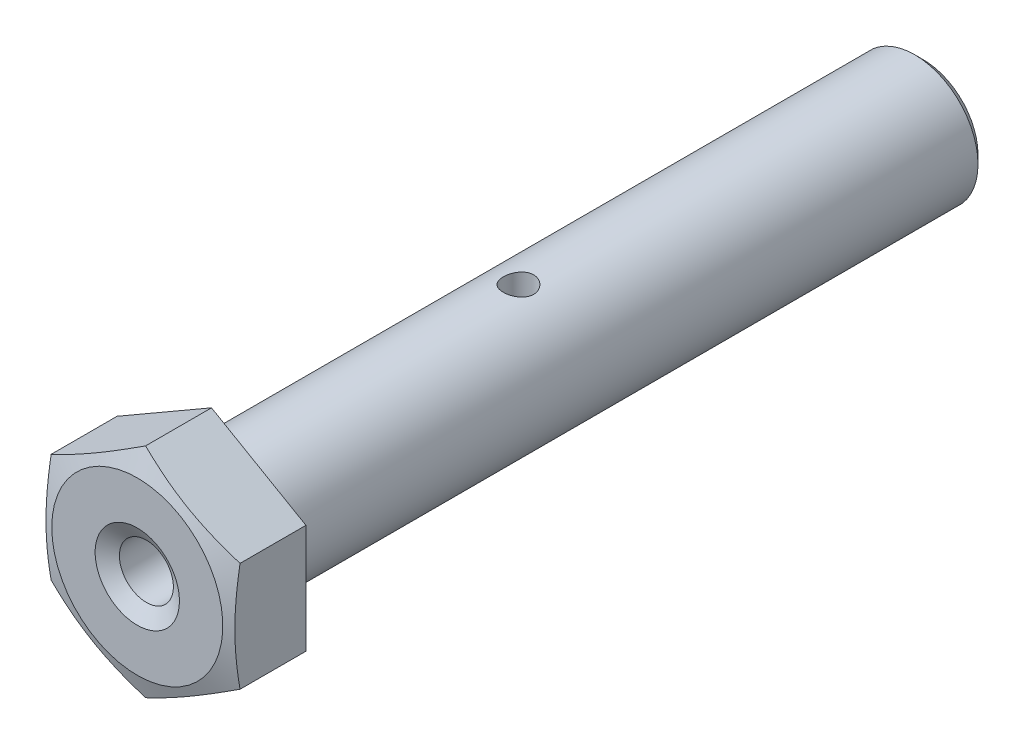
ISO-10303-21;
HEADER;
FILE_DESCRIPTION(('STEP AP214'),'2;1');
FILE_NAME('part.step','',(''),(''),'','','');
FILE_SCHEMA(('AUTOMOTIVE_DESIGN { 1 0 10303 214 1 1 1 1 }'));
ENDSEC;
DATA;
#1=APPLICATION_CONTEXT('core data for automotive mechanical design processes');
#2=APPLICATION_PROTOCOL_DEFINITION('international standard','automotive_design',2000,#1);
#3=PRODUCT_CONTEXT('',#1,'mechanical');
#4=PRODUCT('Part','Part','',(#3));
#5=PRODUCT_RELATED_PRODUCT_CATEGORY('part','',(#4));
#6=PRODUCT_DEFINITION_FORMATION('','',#4);
#7=PRODUCT_DEFINITION_CONTEXT('part definition',#1,'design');
#8=PRODUCT_DEFINITION('design','',#6,#7);
#9=PRODUCT_DEFINITION_SHAPE('','',#8);
#10=(LENGTH_UNIT() NAMED_UNIT(*) SI_UNIT(.MILLI.,.METRE.));
#11=(NAMED_UNIT(*) PLANE_ANGLE_UNIT() SI_UNIT($,.RADIAN.));
#12=(NAMED_UNIT(*) SI_UNIT($,.STERADIAN.) SOLID_ANGLE_UNIT());
#13=UNCERTAINTY_MEASURE_WITH_UNIT(LENGTH_MEASURE(1.E-05),#10,'distance_accuracy_value','');
#14=(GEOMETRIC_REPRESENTATION_CONTEXT(3) GLOBAL_UNCERTAINTY_ASSIGNED_CONTEXT((#13)) GLOBAL_UNIT_ASSIGNED_CONTEXT((#10,
#11,#12)) REPRESENTATION_CONTEXT('',''));
#15=CARTESIAN_POINT('',(0.,0.,0.));
#16=DIRECTION('',(0.,0.,1.));
#17=DIRECTION('',(1.,0.,0.));
#18=AXIS2_PLACEMENT_3D('',#15,#16,#17);
#19=CARTESIAN_POINT('',(0.,0.,4.95721434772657));
#20=DIRECTION('',(0.,0.,-1.));
#21=DIRECTION('',(-1.,0.,0.));
#22=AXIS2_PLACEMENT_3D('',#19,#20,#21);
#23=CONICAL_SURFACE('',#22,8.22286118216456,1.23066390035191);
#24=CARTESIAN_POINT('',(-7.11200000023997,4.1061151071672,4.960976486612));
#25=CARTESIAN_POINT('',(-6.81737936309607,4.27621441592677,5.02119241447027));
#26=CARTESIAN_POINT('',(-6.52183875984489,4.44684486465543,5.07595591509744));
#27=CARTESIAN_POINT('',(-5.92894062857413,4.78915476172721,5.17228765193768));
#28=CARTESIAN_POINT('',(-5.63158192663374,4.96083488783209,5.21384617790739));
#29=CARTESIAN_POINT('',(-5.03816993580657,5.30344146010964,5.28108026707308));
#30=CARTESIAN_POINT('',(-4.74212876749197,5.47436090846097,5.30689459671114));
#31=CARTESIAN_POINT('',(-4.14939155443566,5.81657789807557,5.3415176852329));
#32=CARTESIAN_POINT('',(-3.85269577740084,5.98787528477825,5.35033243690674));
#33=CARTESIAN_POINT('',(-3.25930422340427,6.3304700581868,5.35033243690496));
#34=CARTESIAN_POINT('',(-2.96260844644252,6.50176744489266,5.3415176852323));
#35=CARTESIAN_POINT('',(-2.36987123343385,6.84398443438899,5.30689459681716));
#36=CARTESIAN_POINT('',(-2.0738300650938,7.01490388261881,5.2810802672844));
#37=CARTESIAN_POINT('',(-1.48041807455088,7.35751045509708,5.21384617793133));
#38=CARTESIAN_POINT('',(-1.18305937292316,7.52919058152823,5.17228765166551));
#39=CARTESIAN_POINT('',(-0.590161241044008,7.87150047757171,5.075955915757));
#40=CARTESIAN_POINT('',(-0.294620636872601,8.04213092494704,5.02119241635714));
#41=CARTESIAN_POINT('',(2.60407290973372E-09,8.2122302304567,4.96097649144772));
#42=B_SPLINE_CURVE_WITH_KNOTS('',3,(#24,#25,#26,#27,#28,#29,#30,#31,#32,#33,#34,#35,#36,#37,#38,
#39,#40,#41),.UNSPECIFIED.,.F.,.F.,(4,2,2,2,2,2,2,2,4),(0.,1.03656037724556,2.07388123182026,
3.1019219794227,4.12960024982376,5.15727852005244,6.18531926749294,7.22264012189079,
8.25920049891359),.UNSPECIFIED.);
#43=CARTESIAN_POINT('',(-7.11200000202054,4.10611511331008,4.96097649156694));
#44=VERTEX_POINT('',#43);
#45=CARTESIAN_POINT('',(0.,8.21223023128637,4.96097649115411));
#46=VERTEX_POINT('',#45);
#47=EDGE_CURVE('E20',#44,#46,#42,.T.);
#48=ORIENTED_EDGE('',*,*,#47,.F.);
#49=CARTESIAN_POINT('',(-7.11199999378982,4.10611511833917,4.960976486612));
#50=CARTESIAN_POINT('',(-7.11199999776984,3.76591650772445,5.02119241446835));
#51=CARTESIAN_POINT('',(-7.11199999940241,3.42465561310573,5.07595591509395));
#52=CARTESIAN_POINT('',(-7.11200000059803,2.74003582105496,5.17228765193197));
#53=CARTESIAN_POINT('',(-7.11200000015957,2.39667556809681,5.21384617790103));
#54=CARTESIAN_POINT('',(-7.11199999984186,1.71146242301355,5.28108026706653));
#55=CARTESIAN_POINT('',(-7.11199999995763,1.36962352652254,5.30689459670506));
#56=CARTESIAN_POINT('',(-7.11200000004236,0.685189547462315,5.34151768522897));
#57=CARTESIAN_POINT('',(-7.11200000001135,0.342594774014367,5.3503324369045));
#58=CARTESIAN_POINT('',(-7.11199999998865,-0.342594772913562,5.35033243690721));
#59=CARTESIAN_POINT('',(-7.11199999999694,-0.685189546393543,5.34151768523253));
#60=CARTESIAN_POINT('',(-7.11200000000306,-1.36962352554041,5.30689459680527));
#61=CARTESIAN_POINT('',(-7.11200000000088,-1.71146242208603,5.28108026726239));
#62=CARTESIAN_POINT('',(-7.11199999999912,-2.39667556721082,5.21384617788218));
#63=CARTESIAN_POINT('',(-7.11199999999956,-2.74003582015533,5.17228765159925));
#64=CARTESIAN_POINT('',(-7.11200000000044,-3.42465561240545,5.07595591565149));
#65=CARTESIAN_POINT('',(-7.11200000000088,-3.76591650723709,5.0211924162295));
#66=CARTESIAN_POINT('',(-7.112,-4.10611511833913,4.96097649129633));
#67=B_SPLINE_CURVE_WITH_KNOTS('',3,(#49,#50,#51,#52,#53,#54,#55,#56,#57,#58,#59,#60,#61,#62,#63,
#64,#65,#66),.UNSPECIFIED.,.F.,.F.,(4,2,2,2,2,2,2,2,4),(0.,1.03656037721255,2.07388123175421,
3.10192197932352,4.12960024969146,5.1572785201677,6.18531926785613,7.22264012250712,
8.25920049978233),.UNSPECIFIED.);
#68=CARTESIAN_POINT('',(-7.11200000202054,-4.10611511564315,4.96097649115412));
#69=VERTEX_POINT('',#68);
#70=EDGE_CURVE('E73',#44,#69,#67,.T.);
#71=ORIENTED_EDGE('',*,*,#70,.T.);
#72=CARTESIAN_POINT('',(6.45011977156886E-09,-8.21223022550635,4.960976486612));
#73=CARTESIAN_POINT('',(-0.294620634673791,-8.04213092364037,5.02119241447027));
#74=CARTESIAN_POINT('',(-0.590161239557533,-7.8715004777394,5.07595591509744));
#75=CARTESIAN_POINT('',(-1.18305937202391,-7.52919058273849,5.17228765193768));
#76=CARTESIAN_POINT('',(-1.48041807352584,-7.35751045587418,5.21384617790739));
#77=CARTESIAN_POINT('',(-2.07383006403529,-7.01490388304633,5.28108026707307));
#78=CARTESIAN_POINT('',(-2.36987123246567,-6.84398443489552,5.30689459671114));
#79=CARTESIAN_POINT('',(-2.9626084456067,-6.50176744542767,5.3415176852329));
#80=CARTESIAN_POINT('',(-3.25930422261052,-6.33047005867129,5.35033243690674));
#81=CARTESIAN_POINT('',(-3.85269577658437,-5.98787528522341,5.35033243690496));
#82=CARTESIAN_POINT('',(-4.14939155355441,-5.81657789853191,5.3415176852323));
#83=CARTESIAN_POINT('',(-4.74212876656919,-5.47436090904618,5.30689459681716));
#84=CARTESIAN_POINT('',(-5.03816993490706,-5.30344146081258,5.28108026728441));
#85=CARTESIAN_POINT('',(-5.63158192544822,-4.96083488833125,5.21384617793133));
#86=CARTESIAN_POINT('',(-5.92894062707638,-4.78915476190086,5.17228765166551));
#87=CARTESIAN_POINT('',(-6.52183875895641,-4.44684486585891,5.07595591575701));
#88=CARTESIAN_POINT('',(-6.81737936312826,-4.27621441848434,5.02119241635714));
#89=CARTESIAN_POINT('',(-7.11200000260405,-4.10611511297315,4.96097649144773));
#90=B_SPLINE_CURVE_WITH_KNOTS('',3,(#72,#73,#74,#75,#76,#77,#78,#79,#80,#81,#82,#83,#84,#85,#86,
#87,#88,#89),.UNSPECIFIED.,.F.,.F.,(4,2,2,2,2,2,2,2,4),(0.,1.03656037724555,2.07388123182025,
3.10192197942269,4.12960024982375,5.15727852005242,6.18531926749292,7.22264012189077,
8.25920049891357),.UNSPECIFIED.);
#91=CARTESIAN_POINT('',(0.,-8.21223023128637,4.96097649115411));
#92=VERTEX_POINT('',#91);
#93=EDGE_CURVE('E102',#92,#69,#90,.T.);
#94=ORIENTED_EDGE('',*,*,#93,.F.);
#95=CARTESIAN_POINT('',(7.11200000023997,-4.1061151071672,4.96097648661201));
#96=CARTESIAN_POINT('',(6.81737936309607,-4.27621441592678,5.02119241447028));
#97=CARTESIAN_POINT('',(6.52183875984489,-4.44684486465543,5.07595591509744));
#98=CARTESIAN_POINT('',(5.92894062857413,-4.78915476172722,5.17228765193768));
#99=CARTESIAN_POINT('',(5.63158192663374,-4.96083488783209,5.21384617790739));
#100=CARTESIAN_POINT('',(5.03816993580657,-5.30344146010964,5.28108026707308));
#101=CARTESIAN_POINT('',(4.74212876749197,-5.47436090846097,5.30689459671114));
#102=CARTESIAN_POINT('',(4.14939155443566,-5.81657789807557,5.3415176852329));
#103=CARTESIAN_POINT('',(3.85269577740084,-5.98787528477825,5.35033243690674));
#104=CARTESIAN_POINT('',(3.25930422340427,-6.3304700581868,5.35033243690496));
#105=CARTESIAN_POINT('',(2.96260844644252,-6.50176744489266,5.3415176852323));
#106=CARTESIAN_POINT('',(2.36987123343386,-6.84398443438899,5.30689459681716));
#107=CARTESIAN_POINT('',(2.0738300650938,-7.01490388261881,5.28108026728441));
#108=CARTESIAN_POINT('',(1.48041807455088,-7.35751045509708,5.21384617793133));
#109=CARTESIAN_POINT('',(1.18305937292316,-7.52919058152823,5.17228765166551));
#110=CARTESIAN_POINT('',(0.590161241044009,-7.8715004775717,5.075955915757));
#111=CARTESIAN_POINT('',(0.294620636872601,-8.04213092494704,5.02119241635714));
#112=CARTESIAN_POINT('',(-2.6040717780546E-09,-8.2122302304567,4.96097649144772));
#113=B_SPLINE_CURVE_WITH_KNOTS('',3,(#95,#96,#97,#98,#99,#100,#101,#102,#103,#104,#105,#106,
#107,#108,#109,#110,#111,#112),.UNSPECIFIED.,.F.,.F.,(4,2,2,2,2,2,2,2,4),(0.,1.03656037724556,
2.07388123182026,3.1019219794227,4.12960024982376,5.15727852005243,6.18531926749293,
7.22264012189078,8.25920049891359),.UNSPECIFIED.);
#114=CARTESIAN_POINT('',(7.11200000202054,-4.1061151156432,4.96097649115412));
#115=VERTEX_POINT('',#114);
#116=EDGE_CURVE('E126',#115,#92,#113,.T.);
#117=ORIENTED_EDGE('',*,*,#116,.F.);
#118=CARTESIAN_POINT('',(7.11199999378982,4.10611511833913,4.96097648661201));
#119=CARTESIAN_POINT('',(7.11199999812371,3.76591650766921,5.02119241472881));
#120=CARTESIAN_POINT('',(7.1119999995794,3.42465561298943,5.07595591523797));
#121=CARTESIAN_POINT('',(7.11200000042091,2.74003582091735,5.17228765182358));
#122=CARTESIAN_POINT('',(7.11199999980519,2.39667556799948,5.2138461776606));
#123=CARTESIAN_POINT('',(7.11200000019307,1.71146242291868,5.28108026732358));
#124=CARTESIAN_POINT('',(7.11200000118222,1.36962352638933,5.30689459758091));
#125=CARTESIAN_POINT('',(7.1119999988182,0.685189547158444,5.34151768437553));
#126=CARTESIAN_POINT('',(7.11199999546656,0.342594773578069,5.35033243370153));
#127=CARTESIAN_POINT('',(7.11199999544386,-0.342594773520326,5.35033243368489));
#128=CARTESIAN_POINT('',(7.11199999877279,-0.685189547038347,5.34151768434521));
#129=CARTESIAN_POINT('',(7.11200000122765,-1.36962352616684,5.30689459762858));
#130=CARTESIAN_POINT('',(7.11200000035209,-1.71146242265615,5.28108026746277));
#131=CARTESIAN_POINT('',(7.11199999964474,-2.39667556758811,5.21384617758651));
#132=CARTESIAN_POINT('',(7.11199999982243,-2.74003582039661,5.17228765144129));
#133=CARTESIAN_POINT('',(7.11200000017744,-3.42465561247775,5.07595591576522));
#134=CARTESIAN_POINT('',(7.11200000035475,-3.76591650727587,5.02119241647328));
#135=CARTESIAN_POINT('',(7.112,-4.10611511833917,4.96097649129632));
#136=B_SPLINE_CURVE_WITH_KNOTS('',3,(#118,#119,#120,#121,#122,#123,#124,#125,#126,#127,#128,
#129,#130,#131,#132,#133,#134,#135),.UNSPECIFIED.,.F.,.F.,(4,2,2,2,2,2,2,2,4),(0.,
1.03656037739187,2.07388123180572,3.10192197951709,4.12960025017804,5.15727852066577,
6.18531926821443,7.22264012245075,8.25920049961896),.UNSPECIFIED.);
#137=CARTESIAN_POINT('',(7.11200000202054,4.10611511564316,4.96097649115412));
#138=VERTEX_POINT('',#137);
#139=EDGE_CURVE('E133',#138,#115,#136,.T.);
#140=ORIENTED_EDGE('',*,*,#139,.F.);
#141=CARTESIAN_POINT('',(-6.45011611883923E-09,8.21223022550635,4.960976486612));
#142=CARTESIAN_POINT('',(0.294620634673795,8.04213092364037,5.02119241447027));
#143=CARTESIAN_POINT('',(0.590161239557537,7.8715004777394,5.07595591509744));
#144=CARTESIAN_POINT('',(1.18305937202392,7.52919058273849,5.17228765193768));
#145=CARTESIAN_POINT('',(1.48041807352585,7.35751045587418,5.21384617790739));
#146=CARTESIAN_POINT('',(2.0738300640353,7.01490388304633,5.28108026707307));
#147=CARTESIAN_POINT('',(2.36987123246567,6.84398443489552,5.30689459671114));
#148=CARTESIAN_POINT('',(2.96260844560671,6.50176744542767,5.3415176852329));
#149=CARTESIAN_POINT('',(3.25930422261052,6.33047005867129,5.35033243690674));
#150=CARTESIAN_POINT('',(3.85269577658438,5.98787528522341,5.35033243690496));
#151=CARTESIAN_POINT('',(4.14939155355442,5.81657789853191,5.3415176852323));
#152=CARTESIAN_POINT('',(4.7421287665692,5.47436090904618,5.30689459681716));
#153=CARTESIAN_POINT('',(5.03816993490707,5.30344146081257,5.28108026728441));
#154=CARTESIAN_POINT('',(5.63158192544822,4.96083488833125,5.21384617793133));
#155=CARTESIAN_POINT('',(5.92894062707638,4.78915476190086,5.17228765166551));
#156=CARTESIAN_POINT('',(6.52183875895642,4.44684486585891,5.075955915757));
#157=CARTESIAN_POINT('',(6.81737936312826,4.27621441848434,5.02119241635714));
#158=CARTESIAN_POINT('',(7.11200000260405,4.10611511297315,4.96097649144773));
#159=B_SPLINE_CURVE_WITH_KNOTS('',3,(#141,#142,#143,#144,#145,#146,#147,#148,#149,#150,#151,
#152,#153,#154,#155,#156,#157,#158),.UNSPECIFIED.,.F.,.F.,(4,2,2,2,2,2,2,2,4),(0.,
1.03656037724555,2.07388123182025,3.10192197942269,4.12960024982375,5.15727852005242,
6.18531926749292,7.22264012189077,8.25920049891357),.UNSPECIFIED.);
#160=EDGE_CURVE('E76',#46,#138,#159,.T.);
#161=ORIENTED_EDGE('',*,*,#160,.F.);
#162=EDGE_LOOP('',(#48,#71,#94,#117,#140,#161));
#163=FACE_BOUND('',#162,.T.);
#164=CARTESIAN_POINT('',(0.,0.,5.58800002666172));
#165=DIRECTION('',(0.,0.,-1.));
#166=DIRECTION('',(-1.,0.,0.));
#167=AXIS2_PLACEMENT_3D('',#164,#165,#166);
#168=CIRCLE('',#167,6.44040612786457);
#169=CARTESIAN_POINT('',(-6.44040612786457,0.,5.58800002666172));
#170=VERTEX_POINT('',#169);
#171=EDGE_CURVE('E92',#170,#170,#168,.T.);
#172=ORIENTED_EDGE('',*,*,#171,.T.);
#173=EDGE_LOOP('',(#172));
#174=FACE_BOUND('',#173,.T.);
#175=ADVANCED_FACE('F16',(#163,#174),#23,.T.);
#176=CARTESIAN_POINT('',(-7.112,4.10611511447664,5.588));
#177=DIRECTION('',(-0.499999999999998,0.86602540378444,0.));
#178=DIRECTION('',(-0.86602540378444,-0.499999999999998,0.));
#179=AXIS2_PLACEMENT_3D('',#176,#177,#178);
#180=PLANE('',#179);
#181=DIRECTION('',(0.,0.,1.));
#182=VECTOR('',#181,1.);
#183=CARTESIAN_POINT('',(0.,8.21223022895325,5.588));
#184=LINE('',#183,#182);
#185=CARTESIAN_POINT('',(0.,8.21223022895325,0.));
#186=VERTEX_POINT('',#185);
#187=EDGE_CURVE('E79',#186,#46,#184,.T.);
#188=ORIENTED_EDGE('',*,*,#187,.F.);
#189=DIRECTION('',(0.86602540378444,0.499999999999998,0.));
#190=VECTOR('',#189,1.);
#191=CARTESIAN_POINT('',(-7.112,4.10611511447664,0.));
#192=LINE('',#191,#190);
#193=CARTESIAN_POINT('',(-7.112,4.10611511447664,0.));
#194=VERTEX_POINT('',#193);
#195=EDGE_CURVE('E84',#194,#186,#192,.T.);
#196=ORIENTED_EDGE('',*,*,#195,.F.);
#197=DIRECTION('',(0.,0.,-1.));
#198=VECTOR('',#197,1.);
#199=CARTESIAN_POINT('',(-7.112,4.10611511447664,5.588));
#200=LINE('',#199,#198);
#201=EDGE_CURVE('E81',#194,#44,#200,.F.);
#202=ORIENTED_EDGE('',*,*,#201,.T.);
#203=ORIENTED_EDGE('',*,*,#47,.T.);
#204=EDGE_LOOP('',(#188,#196,#202,#203));
#205=FACE_BOUND('',#204,.T.);
#206=ADVANCED_FACE('F82',(#205),#180,.T.);
#207=CARTESIAN_POINT('',(0.,8.21223022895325,5.588));
#208=DIRECTION('',(0.500000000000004,0.866025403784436,0.));
#209=DIRECTION('',(-0.866025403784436,0.500000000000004,0.));
#210=AXIS2_PLACEMENT_3D('',#207,#208,#209);
#211=PLANE('',#210);
#212=DIRECTION('',(0.,0.,-1.));
#213=VECTOR('',#212,1.);
#214=CARTESIAN_POINT('',(7.112,4.10611511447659,5.588));
#215=LINE('',#214,#213);
#216=CARTESIAN_POINT('',(7.112,4.10611511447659,0.));
#217=VERTEX_POINT('',#216);
#218=EDGE_CURVE('E137',#217,#138,#215,.F.);
#219=ORIENTED_EDGE('',*,*,#218,.F.);
#220=DIRECTION('',(0.866025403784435,-0.500000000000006,0.));
#221=VECTOR('',#220,1.);
#222=CARTESIAN_POINT('',(0.,8.21223022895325,0.));
#223=LINE('',#222,#221);
#224=EDGE_CURVE('E237',#186,#217,#223,.T.);
#225=ORIENTED_EDGE('',*,*,#224,.F.);
#226=ORIENTED_EDGE('',*,*,#187,.T.);
#227=ORIENTED_EDGE('',*,*,#160,.T.);
#228=EDGE_LOOP('',(#219,#225,#226,#227));
#229=FACE_BOUND('',#228,.T.);
#230=ADVANCED_FACE('F141',(#229),#211,.T.);
#231=CARTESIAN_POINT('',(7.112,4.10611511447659,5.588));
#232=DIRECTION('',(1.,0.,0.));
#233=DIRECTION('',(0.,0.,-1.));
#234=AXIS2_PLACEMENT_3D('',#231,#232,#233);
#235=PLANE('',#234);
#236=DIRECTION('',(0.,0.,1.));
#237=VECTOR('',#236,1.);
#238=CARTESIAN_POINT('',(7.112,-4.10611511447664,5.588));
#239=LINE('',#238,#237);
#240=CARTESIAN_POINT('',(7.112,-4.10611511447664,0.));
#241=VERTEX_POINT('',#240);
#242=EDGE_CURVE('E132',#241,#115,#239,.T.);
#243=ORIENTED_EDGE('',*,*,#242,.F.);
#244=DIRECTION('',(0.,1.,0.));
#245=VECTOR('',#244,1.);
#246=CARTESIAN_POINT('',(7.112,12.3183453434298,0.));
#247=LINE('',#246,#245);
#248=EDGE_CURVE('E227',#217,#241,#247,.F.);
#249=ORIENTED_EDGE('',*,*,#248,.F.);
#250=ORIENTED_EDGE('',*,*,#218,.T.);
#251=ORIENTED_EDGE('',*,*,#139,.T.);
#252=EDGE_LOOP('',(#243,#249,#250,#251));
#253=FACE_BOUND('',#252,.T.);
#254=ADVANCED_FACE('F122',(#253),#235,.T.);
#255=CARTESIAN_POINT('',(7.112,-4.10611511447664,5.588));
#256=DIRECTION('',(0.499999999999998,-0.86602540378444,0.));
#257=DIRECTION('',(0.86602540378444,0.499999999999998,0.));
#258=AXIS2_PLACEMENT_3D('',#255,#256,#257);
#259=PLANE('',#258);
#260=DIRECTION('',(0.,0.,1.));
#261=VECTOR('',#260,1.);
#262=CARTESIAN_POINT('',(0.,-8.21223022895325,5.588));
#263=LINE('',#262,#261);
#264=CARTESIAN_POINT('',(0.,-8.21223022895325,0.));
#265=VERTEX_POINT('',#264);
#266=EDGE_CURVE('E131',#265,#92,#263,.T.);
#267=ORIENTED_EDGE('',*,*,#266,.F.);
#268=DIRECTION('',(-0.86602540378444,-0.499999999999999,0.));
#269=VECTOR('',#268,1.);
#270=CARTESIAN_POINT('',(7.112,-4.10611511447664,0.));
#271=LINE('',#270,#269);
#272=EDGE_CURVE('E222',#241,#265,#271,.T.);
#273=ORIENTED_EDGE('',*,*,#272,.F.);
#274=ORIENTED_EDGE('',*,*,#242,.T.);
#275=ORIENTED_EDGE('',*,*,#116,.T.);
#276=EDGE_LOOP('',(#267,#273,#274,#275));
#277=FACE_BOUND('',#276,.T.);
#278=ADVANCED_FACE('F117',(#277),#259,.T.);
#279=CARTESIAN_POINT('',(0.,-8.21223022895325,5.588));
#280=DIRECTION('',(-0.500000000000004,-0.866025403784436,0.));
#281=DIRECTION('',(0.866025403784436,-0.500000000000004,0.));
#282=AXIS2_PLACEMENT_3D('',#279,#280,#281);
#283=PLANE('',#282);
#284=DIRECTION('',(0.,0.,-1.));
#285=VECTOR('',#284,1.);
#286=CARTESIAN_POINT('',(-7.112,-4.10611511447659,5.588));
#287=LINE('',#286,#285);
#288=CARTESIAN_POINT('',(-7.112,-4.10611511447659,0.));
#289=VERTEX_POINT('',#288);
#290=EDGE_CURVE('E88',#69,#289,#287,.T.);
#291=ORIENTED_EDGE('',*,*,#290,.T.);
#292=DIRECTION('',(-0.866025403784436,0.500000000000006,0.));
#293=VECTOR('',#292,1.);
#294=CARTESIAN_POINT('',(0.,-8.21223022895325,0.));
#295=LINE('',#294,#293);
#296=EDGE_CURVE('E218',#265,#289,#295,.T.);
#297=ORIENTED_EDGE('',*,*,#296,.F.);
#298=ORIENTED_EDGE('',*,*,#266,.T.);
#299=ORIENTED_EDGE('',*,*,#93,.T.);
#300=EDGE_LOOP('',(#291,#297,#298,#299));
#301=FACE_BOUND('',#300,.T.);
#302=ADVANCED_FACE('F112',(#301),#283,.T.);
#303=CARTESIAN_POINT('',(-7.112,4.10611511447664,5.588));
#304=DIRECTION('',(1.,0.,0.));
#305=DIRECTION('',(0.,0.,-1.));
#306=AXIS2_PLACEMENT_3D('',#303,#304,#305);
#307=PLANE('',#306);
#308=ORIENTED_EDGE('',*,*,#201,.F.);
#309=DIRECTION('',(0.,1.,0.));
#310=VECTOR('',#309,1.);
#311=CARTESIAN_POINT('',(-7.112,12.3183453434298,0.));
#312=LINE('',#311,#310);
#313=EDGE_CURVE('E219',#289,#194,#312,.T.);
#314=ORIENTED_EDGE('',*,*,#313,.F.);
#315=ORIENTED_EDGE('',*,*,#290,.F.);
#316=ORIENTED_EDGE('',*,*,#70,.F.);
#317=EDGE_LOOP('',(#308,#314,#315,#316));
#318=FACE_BOUND('',#317,.T.);
#319=ADVANCED_FACE('F91',(#318),#307,.F.);
#320=CARTESIAN_POINT('',(7.112,12.3183453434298,5.588));
#321=DIRECTION('',(0.,0.,-1.));
#322=DIRECTION('',(-1.,0.,0.));
#323=AXIS2_PLACEMENT_3D('',#320,#321,#322);
#324=PLANE('',#323);
#325=CARTESIAN_POINT('',(0.,0.,5.58799997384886));
#326=DIRECTION('',(0.,0.,1.));
#327=DIRECTION('',(1.,0.,0.));
#328=AXIS2_PLACEMENT_3D('',#325,#326,#327);
#329=CIRCLE('',#328,3.1750000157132);
#330=CARTESIAN_POINT('',(3.1750000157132,0.,5.58799997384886));
#331=VERTEX_POINT('',#330);
#332=EDGE_CURVE('E225',#331,#331,#329,.F.);
#333=ORIENTED_EDGE('',*,*,#332,.T.);
#334=EDGE_LOOP('',(#333));
#335=FACE_BOUND('',#334,.T.);
#336=ORIENTED_EDGE('',*,*,#171,.F.);
#337=EDGE_LOOP('',(#336));
#338=FACE_BOUND('',#337,.T.);
#339=ADVANCED_FACE('F111',(#335,#338),#324,.F.);
#340=CARTESIAN_POINT('',(7.112,12.3183453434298,0.));
#341=DIRECTION('',(0.,0.,-1.));
#342=DIRECTION('',(-1.,0.,0.));
#343=AXIS2_PLACEMENT_3D('',#340,#341,#342);
#344=PLANE('',#343);
#345=CARTESIAN_POINT('',(0.,0.,0.));
#346=DIRECTION('',(0.,0.,-1.));
#347=DIRECTION('',(-1.,0.,0.));
#348=AXIS2_PLACEMENT_3D('',#345,#346,#347);
#349=CIRCLE('',#348,6.096);
#350=CARTESIAN_POINT('',(-6.096,0.,0.));
#351=VERTEX_POINT('',#350);
#352=EDGE_CURVE('E214',#351,#351,#349,.T.);
#353=ORIENTED_EDGE('',*,*,#352,.F.);
#354=EDGE_LOOP('',(#353));
#355=FACE_BOUND('',#354,.T.);
#356=ORIENTED_EDGE('',*,*,#296,.T.);
#357=ORIENTED_EDGE('',*,*,#313,.T.);
#358=ORIENTED_EDGE('',*,*,#195,.T.);
#359=ORIENTED_EDGE('',*,*,#224,.T.);
#360=ORIENTED_EDGE('',*,*,#248,.T.);
#361=ORIENTED_EDGE('',*,*,#272,.T.);
#362=EDGE_LOOP('',(#356,#357,#358,#359,#360,#361));
#363=FACE_BOUND('',#362,.T.);
#364=ADVANCED_FACE('F203',(#355,#363),#344,.T.);
#365=CARTESIAN_POINT('',(0.,0.,5.58799997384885));
#366=DIRECTION('',(0.,0.,1.));
#367=DIRECTION('',(1.,0.,0.));
#368=AXIS2_PLACEMENT_3D('',#365,#366,#367);
#369=CONICAL_SURFACE('',#368,3.17500001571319,1.0297442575);
#370=ORIENTED_EDGE('',*,*,#332,.F.);
#371=EDGE_LOOP('',(#370));
#372=FACE_BOUND('',#371,.T.);
#373=CARTESIAN_POINT('',(0.,0.,4.9012163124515));
#374=DIRECTION('',(0.,0.,-1.));
#375=DIRECTION('',(-1.,0.,0.));
#376=AXIS2_PLACEMENT_3D('',#373,#374,#375);
#377=CIRCLE('',#376,2.032);
#378=CARTESIAN_POINT('',(-2.032,0.,4.9012163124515));
#379=VERTEX_POINT('',#378);
#380=EDGE_CURVE('E266',#379,#379,#377,.T.);
#381=ORIENTED_EDGE('',*,*,#380,.T.);
#382=EDGE_LOOP('',(#381));
#383=FACE_BOUND('',#382,.T.);
#384=ADVANCED_FACE('F201',(#372,#383),#369,.F.);
#385=CARTESIAN_POINT('',(0.,0.,-25.0417126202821));
#386=DIRECTION('',(0.,0.,1.));
#387=DIRECTION('',(1.,0.,0.));
#388=AXIS2_PLACEMENT_3D('',#385,#386,#387);
#389=CONICAL_SURFACE('',#388,2.03200159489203,1.39626339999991);
#390=CARTESIAN_POINT('',(1.77635683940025E-12,0.,-25.4000093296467));
#391=VERTEX_POINT('',#390);
#392=VERTEX_LOOP('',#391);
#393=FACE_BOUND('',#392,.T.);
#394=CARTESIAN_POINT('',(0.,0.,-25.0417129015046));
#395=DIRECTION('',(0.,0.,1.));
#396=DIRECTION('',(1.,0.,0.));
#397=AXIS2_PLACEMENT_3D('',#394,#395,#396);
#398=CIRCLE('',#397,2.032);
#399=CARTESIAN_POINT('',(2.032,0.,-25.0417129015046));
#400=VERTEX_POINT('',#399);
#401=EDGE_CURVE('E269',#400,#400,#398,.T.);
#402=ORIENTED_EDGE('',*,*,#401,.T.);
#403=EDGE_LOOP('',(#402));
#404=FACE_BOUND('',#403,.T.);
#405=ADVANCED_FACE('F197',(#393,#404),#389,.F.);
#406=CARTESIAN_POINT('',(0.,0.,0.));
#407=DIRECTION('',(0.,0.,-1.));
#408=DIRECTION('',(-1.,0.,0.));
#409=AXIS2_PLACEMENT_3D('',#406,#407,#408);
#410=CYLINDRICAL_SURFACE('',#409,6.096);
#411=CARTESIAN_POINT('',(0.,0.,-0.508));
#412=DIRECTION('',(0.,0.,-1.));
#413=DIRECTION('',(-1.,0.,0.));
#414=AXIS2_PLACEMENT_3D('',#411,#412,#413);
#415=CIRCLE('',#414,6.096);
#416=CARTESIAN_POINT('',(-6.096,0.,-0.508));
#417=VERTEX_POINT('',#416);
#418=EDGE_CURVE('E280',#417,#417,#415,.F.);
#419=ORIENTED_EDGE('',*,*,#418,.T.);
#420=EDGE_LOOP('',(#419));
#421=FACE_BOUND('',#420,.T.);
#422=ORIENTED_EDGE('',*,*,#352,.T.);
#423=EDGE_LOOP('',(#422));
#424=FACE_BOUND('',#423,.T.);
#425=ADVANCED_FACE('F193',(#421,#424),#410,.T.);
#426=CARTESIAN_POINT('',(0.,0.,-53.594));
#427=DIRECTION('',(0.,0.,-1.));
#428=DIRECTION('',(-1.,0.,0.));
#429=AXIS2_PLACEMENT_3D('',#426,#427,#428);
#430=PLANE('',#429);
#431=CARTESIAN_POINT('',(0.,0.,-53.594000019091));
#432=DIRECTION('',(0.,0.,1.));
#433=DIRECTION('',(1.,0.,0.));
#434=AXIS2_PLACEMENT_3D('',#431,#432,#433);
#435=CIRCLE('',#434,4.12750001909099);
#436=CARTESIAN_POINT('',(4.12750001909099,0.,-53.594000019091));
#437=VERTEX_POINT('',#436);
#438=EDGE_CURVE('E181',#437,#437,#435,.T.);
#439=ORIENTED_EDGE('',*,*,#438,.F.);
#440=EDGE_LOOP('',(#439));
#441=FACE_BOUND('',#440,.T.);
#442=ADVANCED_FACE('F189',(#441),#430,.T.);
#443=CARTESIAN_POINT('',(0.,0.,0.));
#444=DIRECTION('',(0.,0.,-1.));
#445=DIRECTION('',(-1.,0.,0.));
#446=AXIS2_PLACEMENT_3D('',#443,#444,#445);
#447=CYLINDRICAL_SURFACE('',#446,2.032);
#448=ORIENTED_EDGE('',*,*,#401,.F.);
#449=EDGE_LOOP('',(#448));
#450=FACE_BOUND('',#449,.T.);
#451=CARTESIAN_POINT('',(0.,2.032,-24.257));
#452=CARTESIAN_POINT('',(-0.0592137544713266,2.03200153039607,-24.2570017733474));
#453=CARTESIAN_POINT('',(-0.118417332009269,2.02938970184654,-24.2523782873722));
#454=CARTESIAN_POINT('',(-0.234980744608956,2.01921571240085,-24.2341402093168));
#455=CARTESIAN_POINT('',(-0.292340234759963,2.0116526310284,-24.2205239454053));
#456=CARTESIAN_POINT('',(-0.403420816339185,1.99234694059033,-24.1850234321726));
#457=CARTESIAN_POINT('',(-0.457154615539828,1.98061994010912,-24.1631700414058));
#458=CARTESIAN_POINT('',(-0.560087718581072,1.95401016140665,-24.1120265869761));
#459=CARTESIAN_POINT('',(-0.609285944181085,1.93912663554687,-24.0827347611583));
#460=CARTESIAN_POINT('',(-0.705647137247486,1.90626789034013,-24.0152286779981));
#461=CARTESIAN_POINT('',(-0.752420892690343,1.88814854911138,-23.9765303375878));
#462=CARTESIAN_POINT('',(-0.839188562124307,1.85121976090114,-23.892376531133));
#463=CARTESIAN_POINT('',(-0.879175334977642,1.83240961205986,-23.8469140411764));
#464=CARTESIAN_POINT('',(-0.955458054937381,1.79391551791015,-23.7448881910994));
#465=CARTESIAN_POINT('',(-0.990931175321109,1.77434579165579,-23.6876611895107));
#466=CARTESIAN_POINT('',(-1.05159777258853,1.7390815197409,-23.5669212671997));
#467=CARTESIAN_POINT('',(-1.07680629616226,1.72338131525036,-23.5034177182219));
#468=CARTESIAN_POINT('',(-1.11149088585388,1.7011588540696,-23.3859207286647));
#469=CARTESIAN_POINT('',(-1.12318412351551,1.69338910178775,-23.3328179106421));
#470=CARTESIAN_POINT('',(-1.1388950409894,1.68286530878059,-23.2250212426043));
#471=CARTESIAN_POINT('',(-1.14292056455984,1.68010614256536,-23.1703290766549));
#472=CARTESIAN_POINT('',(-1.14307720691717,1.67999953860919,-23.0608638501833));
#473=CARTESIAN_POINT('',(-1.1391987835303,1.68265864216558,-23.0060907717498));
#474=CARTESIAN_POINT('',(-1.12375413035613,1.69301019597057,-22.8981189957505));
#475=CARTESIAN_POINT('',(-1.11218278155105,1.70070599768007,-22.8449213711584));
#476=CARTESIAN_POINT('',(-1.08193435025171,1.72010472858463,-22.7414821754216));
#477=CARTESIAN_POINT('',(-1.06326786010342,1.73180168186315,-22.6912363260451));
#478=CARTESIAN_POINT('',(-1.01947059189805,1.7579399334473,-22.5944279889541));
#479=CARTESIAN_POINT('',(-0.994337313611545,1.7723822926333,-22.5478669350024));
#480=CARTESIAN_POINT('',(-0.93379609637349,1.80510585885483,-22.4520595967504));
#481=CARTESIAN_POINT('',(-0.89739795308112,1.82363472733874,-22.4035226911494));
#482=CARTESIAN_POINT('',(-0.817423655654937,1.86085748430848,-22.312795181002));
#483=CARTESIAN_POINT('',(-0.773841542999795,1.8795514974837,-22.2706099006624));
#484=CARTESIAN_POINT('',(-0.675147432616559,1.91736235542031,-22.1892644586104));
#485=CARTESIAN_POINT('',(-0.619301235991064,1.93631126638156,-22.1509080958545));
#486=CARTESIAN_POINT('',(-0.500789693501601,1.97028473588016,-22.0843068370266));
#487=CARTESIAN_POINT('',(-0.438129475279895,1.98531221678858,-22.0560544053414));
#488=CARTESIAN_POINT('',(-0.313657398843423,2.00855165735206,-22.0130913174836));
#489=CARTESIAN_POINT('',(-0.252283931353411,2.01725810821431,-21.997384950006));
#490=CARTESIAN_POINT('',(-0.12726847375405,2.0289791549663,-21.9763444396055));
#491=CARTESIAN_POINT('',(-0.0636283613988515,2.03199835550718,-21.9710019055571));
#492=CARTESIAN_POINT('',(0.0592137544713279,2.03200153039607,-21.9709982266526));
#493=CARTESIAN_POINT('',(0.11841733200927,2.02938970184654,-21.9756217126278));
#494=CARTESIAN_POINT('',(0.234980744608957,2.01921571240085,-21.9938597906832));
#495=CARTESIAN_POINT('',(0.292340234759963,2.0116526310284,-22.0074760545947));
#496=CARTESIAN_POINT('',(0.403420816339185,1.99234694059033,-22.0429765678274));
#497=CARTESIAN_POINT('',(0.457154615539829,1.98061994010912,-22.0648299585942));
#498=CARTESIAN_POINT('',(0.560087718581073,1.95401016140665,-22.1159734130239));
#499=CARTESIAN_POINT('',(0.609285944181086,1.93912663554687,-22.1452652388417));
#500=CARTESIAN_POINT('',(0.705647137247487,1.90626789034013,-22.2127713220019));
#501=CARTESIAN_POINT('',(0.752420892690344,1.88814854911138,-22.2514696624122));
#502=CARTESIAN_POINT('',(0.839188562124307,1.85121976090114,-22.3356234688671));
#503=CARTESIAN_POINT('',(0.879175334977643,1.83240961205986,-22.3810859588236));
#504=CARTESIAN_POINT('',(0.955458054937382,1.79391551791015,-22.4831118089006));
#505=CARTESIAN_POINT('',(0.990931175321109,1.77434579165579,-22.5403388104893));
#506=CARTESIAN_POINT('',(1.05159777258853,1.7390815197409,-22.6610787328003));
#507=CARTESIAN_POINT('',(1.07680629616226,1.72338131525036,-22.7245822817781));
#508=CARTESIAN_POINT('',(1.11149088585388,1.7011588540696,-22.8420792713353));
#509=CARTESIAN_POINT('',(1.12318412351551,1.69338910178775,-22.8951820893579));
#510=CARTESIAN_POINT('',(1.1388950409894,1.68286530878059,-23.0029787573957));
#511=CARTESIAN_POINT('',(1.14292056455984,1.68010614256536,-23.0576709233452));
#512=CARTESIAN_POINT('',(1.14307720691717,1.67999953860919,-23.1671361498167));
#513=CARTESIAN_POINT('',(1.1391987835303,1.68265864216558,-23.2219092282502));
#514=CARTESIAN_POINT('',(1.12375413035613,1.69301019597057,-23.3298810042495));
#515=CARTESIAN_POINT('',(1.11218278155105,1.70070599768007,-23.3830786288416));
#516=CARTESIAN_POINT('',(1.08193435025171,1.72010472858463,-23.4865178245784));
#517=CARTESIAN_POINT('',(1.06326786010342,1.73180168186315,-23.5367636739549));
#518=CARTESIAN_POINT('',(1.01947059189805,1.7579399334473,-23.6335720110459));
#519=CARTESIAN_POINT('',(0.994337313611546,1.7723822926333,-23.6801330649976));
#520=CARTESIAN_POINT('',(0.933796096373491,1.80510585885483,-23.7759404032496));
#521=CARTESIAN_POINT('',(0.89739795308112,1.82363472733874,-23.8244773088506));
#522=CARTESIAN_POINT('',(0.817423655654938,1.86085748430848,-23.915204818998));
#523=CARTESIAN_POINT('',(0.773841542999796,1.8795514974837,-23.9573900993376));
#524=CARTESIAN_POINT('',(0.675147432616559,1.91736235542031,-24.0387355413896));
#525=CARTESIAN_POINT('',(0.619301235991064,1.93631126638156,-24.0770919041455));
#526=CARTESIAN_POINT('',(0.500789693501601,1.97028473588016,-24.1436931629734));
#527=CARTESIAN_POINT('',(0.438129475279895,1.98531221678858,-24.1719455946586));
#528=CARTESIAN_POINT('',(0.313657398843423,2.00855165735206,-24.2149086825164));
#529=CARTESIAN_POINT('',(0.252283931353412,2.01725810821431,-24.2306150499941));
#530=CARTESIAN_POINT('',(0.12726847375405,2.0289791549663,-24.2516555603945));
#531=CARTESIAN_POINT('',(0.0636283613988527,2.03199835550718,-24.2569980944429));
#532=CARTESIAN_POINT('',(0.,2.032,-24.257));
#533=B_SPLINE_CURVE_WITH_KNOTS('',3,(#451,#452,#453,#454,#455,#456,#457,#458,#459,#460,#461,
#462,#463,#464,#465,#466,#467,#468,#469,#470,#471,#472,#473,#474,#475,#476,#477,#478,#479,#480,
#481,#482,#483,#484,#485,#486,#487,#488,#489,#490,#491,#492,#493,#494,#495,#496,#497,#498,#499,
#500,#501,#502,#503,#504,#505,#506,#507,#508,#509,#510,#511,#512,#513,#514,#515,#516,#517,#518,
#519,#520,#521,#522,#523,#524,#525,#526,#527,#528,#529,#530,#531,#532),.UNSPECIFIED.,.T.,.F.,(4,
2,2,2,2,2,2,2,2,2,2,2,2,2,2,2,2,2,2,2,2,2,2,2,2,2,2,2,2,2,2,2,2,2,2,2,2,2,2,2,4),(0.,
0.177394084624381,0.354821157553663,0.53159004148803,0.708400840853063,0.89770040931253,
1.08719793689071,1.29650534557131,1.50550482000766,1.6695712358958,1.83346972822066,
1.99756620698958,2.16177198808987,2.32573358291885,2.48975866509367,2.6793045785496,
2.86900850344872,3.07896556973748,3.28876571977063,3.47953972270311,3.67015920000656,
3.84755328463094,4.02498035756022,4.20174924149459,4.37856004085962,4.56785960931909,
4.75735713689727,4.96666454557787,5.17566402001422,5.33973043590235,5.50362892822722,
5.66772540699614,5.83193118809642,5.9958927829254,6.15991786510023,6.34946377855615,
6.53916770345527,6.74912476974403,6.95892491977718,7.14969892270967,7.34031840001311),.UNSPECIFIED.);
#534=CARTESIAN_POINT('',(0.,2.032,-24.257));
#535=VERTEX_POINT('',#534);
#536=EDGE_CURVE('E175',#535,#535,#533,.T.);
#537=ORIENTED_EDGE('',*,*,#536,.T.);
#538=EDGE_LOOP('',(#537));
#539=FACE_BOUND('',#538,.T.);
#540=ORIENTED_EDGE('',*,*,#380,.F.);
#541=EDGE_LOOP('',(#540));
#542=FACE_BOUND('',#541,.T.);
#543=ADVANCED_FACE('F183',(#450,#539,#542),#447,.F.);
#544=CARTESIAN_POINT('',(0.,6.096,-0.508));
#545=DIRECTION('',(0.,0.,1.));
#546=DIRECTION('',(1.,0.,0.));
#547=AXIS2_PLACEMENT_3D('',#544,#545,#546);
#548=PLANE('',#547);
#549=CARTESIAN_POINT('',(0.,0.,-0.508));
#550=DIRECTION('',(0.,0.,-1.));
#551=DIRECTION('',(-1.,0.,0.));
#552=AXIS2_PLACEMENT_3D('',#549,#550,#551);
#553=CIRCLE('',#552,4.7625);
#554=CARTESIAN_POINT('',(-4.7625,0.,-0.508));
#555=VERTEX_POINT('',#554);
#556=EDGE_CURVE('E172',#555,#555,#553,.T.);
#557=ORIENTED_EDGE('',*,*,#556,.F.);
#558=EDGE_LOOP('',(#557));
#559=FACE_BOUND('',#558,.T.);
#560=ORIENTED_EDGE('',*,*,#418,.F.);
#561=EDGE_LOOP('',(#560));
#562=FACE_BOUND('',#561,.T.);
#563=ADVANCED_FACE('F188',(#559,#562),#548,.F.);
#564=CARTESIAN_POINT('',(0.,0.,-52.9590000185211));
#565=DIRECTION('',(0.,0.,1.));
#566=DIRECTION('',(1.,0.,0.));
#567=AXIS2_PLACEMENT_3D('',#564,#565,#566);
#568=CONICAL_SURFACE('',#567,4.7625000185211,0.785398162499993);
#569=CARTESIAN_POINT('',(0.,0.,-52.959));
#570=DIRECTION('',(0.,0.,-1.));
#571=DIRECTION('',(-1.,0.,0.));
#572=AXIS2_PLACEMENT_3D('',#569,#570,#571);
#573=CIRCLE('',#572,4.7625);
#574=CARTESIAN_POINT('',(-4.7625,0.,-52.959));
#575=VERTEX_POINT('',#574);
#576=EDGE_CURVE('E29',#575,#575,#573,.F.);
#577=ORIENTED_EDGE('',*,*,#576,.F.);
#578=EDGE_LOOP('',(#577));
#579=FACE_BOUND('',#578,.T.);
#580=ORIENTED_EDGE('',*,*,#438,.T.);
#581=EDGE_LOOP('',(#580));
#582=FACE_BOUND('',#581,.T.);
#583=ADVANCED_FACE('F159',(#579,#582),#568,.T.);
#584=CARTESIAN_POINT('',(0.,15.5685972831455,-23.114));
#585=DIRECTION('',(0.,1.,0.));
#586=DIRECTION('',(0.,0.,1.));
#587=AXIS2_PLACEMENT_3D('',#584,#585,#586);
#588=CYLINDRICAL_SURFACE('',#587,1.143);
#589=CARTESIAN_POINT('',(0.,4.7625,-24.257));
#590=CARTESIAN_POINT('',(0.0631606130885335,4.76249820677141,-24.2569968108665));
#591=CARTESIAN_POINT('',(0.126396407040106,4.7612295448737,-24.2517416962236));
#592=CARTESIAN_POINT('',(0.251116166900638,4.75628637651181,-24.2308714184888));
#593=CARTESIAN_POINT('',(0.312596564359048,4.75260728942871,-24.2152365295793));
#594=CARTESIAN_POINT('',(0.431903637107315,4.74325204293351,-24.1741323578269));
#595=CARTESIAN_POINT('',(0.489736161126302,4.73757918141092,-24.1486793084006));
#596=CARTESIAN_POINT('',(0.600290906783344,4.72484471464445,-24.0887079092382));
#597=CARTESIAN_POINT('',(0.653014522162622,4.71778348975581,-24.05419204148));
#598=CARTESIAN_POINT('',(0.752889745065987,4.70288840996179,-23.9763701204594));
#599=CARTESIAN_POINT('',(0.799929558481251,4.69504332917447,-23.9329227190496));
#600=CARTESIAN_POINT('',(0.88613182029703,4.67954050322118,-23.8387718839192));
#601=CARTESIAN_POINT('',(0.925293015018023,4.67188278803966,-23.7880672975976));
#602=CARTESIAN_POINT('',(0.995134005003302,4.6575108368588,-23.6799959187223));
#603=CARTESIAN_POINT('',(1.02569177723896,4.65081078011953,-23.6225482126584));
#604=CARTESIAN_POINT('',(1.07667409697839,4.63927440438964,-23.5031453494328));
#605=CARTESIAN_POINT('',(1.09710020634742,4.63443779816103,-23.4411908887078));
#606=CARTESIAN_POINT('',(1.12686486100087,4.62729013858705,-23.3157484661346));
#607=CARTESIAN_POINT('',(1.13640206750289,4.62493389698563,-23.2523102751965));
#608=CARTESIAN_POINT('',(1.14473663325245,4.62287834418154,-23.1246938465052));
#609=CARTESIAN_POINT('',(1.14353558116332,4.62317863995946,-23.0605157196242));
#610=CARTESIAN_POINT('',(1.13058670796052,4.62636150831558,-22.9347488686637));
#611=CARTESIAN_POINT('',(1.11907367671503,4.62918659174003,-22.8731342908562));
#612=CARTESIAN_POINT('',(1.08620120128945,4.6370093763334,-22.7527372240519));
#613=CARTESIAN_POINT('',(1.06484103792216,4.64200723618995,-22.6939549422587));
#614=CARTESIAN_POINT('',(1.01267472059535,4.65366666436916,-22.5802502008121));
#615=CARTESIAN_POINT('',(0.98178140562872,4.66034347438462,-22.5253693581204));
#616=CARTESIAN_POINT('',(0.911489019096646,4.67459905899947,-22.421489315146));
#617=CARTESIAN_POINT('',(0.872089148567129,4.68217791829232,-22.3724906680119));
#618=CARTESIAN_POINT('',(0.784684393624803,4.69762631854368,-22.2804220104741));
#619=CARTESIAN_POINT('',(0.73648224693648,4.70549829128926,-22.2375394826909));
#620=CARTESIAN_POINT('',(0.633455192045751,4.72047096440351,-22.1604147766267));
#621=CARTESIAN_POINT('',(0.578627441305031,4.72757133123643,-22.1261763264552));
#622=CARTESIAN_POINT('',(0.46363569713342,4.74023266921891,-22.0672515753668));
#623=CARTESIAN_POINT('',(0.403452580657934,4.74578780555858,-22.0426013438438));
#624=CARTESIAN_POINT('',(0.279708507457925,4.75468144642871,-22.0038654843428));
#625=CARTESIAN_POINT('',(0.216154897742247,4.75802457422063,-21.989757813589));
#626=CARTESIAN_POINT('',(0.126738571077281,4.76088064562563,-21.9777631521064));
#627=CARTESIAN_POINT('',(0.101464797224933,4.76148643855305,-21.9752293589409));
#628=CARTESIAN_POINT('',(0.0507980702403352,4.76229647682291,-21.9718471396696));
#629=CARTESIAN_POINT('',(0.0254051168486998,4.762500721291,-21.9709987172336));
#630=CARTESIAN_POINT('',(-0.0631606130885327,4.76249820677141,-21.9710031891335));
#631=CARTESIAN_POINT('',(-0.126396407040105,4.7612295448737,-21.9762583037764));
#632=CARTESIAN_POINT('',(-0.251116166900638,4.75628637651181,-21.9971285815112));
#633=CARTESIAN_POINT('',(-0.312596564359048,4.75260728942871,-22.0127634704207));
#634=CARTESIAN_POINT('',(-0.431903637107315,4.74325204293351,-22.0538676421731));
#635=CARTESIAN_POINT('',(-0.489736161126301,4.73757918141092,-22.0793206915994));
#636=CARTESIAN_POINT('',(-0.600290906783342,4.72484471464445,-22.1392920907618));
#637=CARTESIAN_POINT('',(-0.653014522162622,4.71778348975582,-22.17380795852));
#638=CARTESIAN_POINT('',(-0.752889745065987,4.70288840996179,-22.2516298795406));
#639=CARTESIAN_POINT('',(-0.799929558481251,4.69504332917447,-22.2950772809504));
#640=CARTESIAN_POINT('',(-0.88613182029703,4.67954050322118,-22.3892281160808));
#641=CARTESIAN_POINT('',(-0.925293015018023,4.67188278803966,-22.4399327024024));
#642=CARTESIAN_POINT('',(-0.995134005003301,4.6575108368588,-22.5480040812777));
#643=CARTESIAN_POINT('',(-1.02569177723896,4.65081078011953,-22.6054517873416));
#644=CARTESIAN_POINT('',(-1.07667409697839,4.63927440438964,-22.7248546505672));
#645=CARTESIAN_POINT('',(-1.09710020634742,4.63443779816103,-22.7868091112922));
#646=CARTESIAN_POINT('',(-1.12686486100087,4.62729013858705,-22.9122515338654));
#647=CARTESIAN_POINT('',(-1.13640206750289,4.62493389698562,-22.9756897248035));
#648=CARTESIAN_POINT('',(-1.14473663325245,4.62287834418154,-23.1033061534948));
#649=CARTESIAN_POINT('',(-1.14353558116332,4.62317863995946,-23.1674842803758));
#650=CARTESIAN_POINT('',(-1.13058670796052,4.62636150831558,-23.2932511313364));
#651=CARTESIAN_POINT('',(-1.11907367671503,4.62918659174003,-23.3548657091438));
#652=CARTESIAN_POINT('',(-1.08620120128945,4.6370093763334,-23.4752627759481));
#653=CARTESIAN_POINT('',(-1.06484103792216,4.64200723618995,-23.5340450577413));
#654=CARTESIAN_POINT('',(-1.01267472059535,4.65366666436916,-23.6477497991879));
#655=CARTESIAN_POINT('',(-0.981781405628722,4.66034347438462,-23.7026306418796));
#656=CARTESIAN_POINT('',(-0.91148901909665,4.67459905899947,-23.806510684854));
#657=CARTESIAN_POINT('',(-0.872089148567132,4.68217791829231,-23.8555093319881));
#658=CARTESIAN_POINT('',(-0.784684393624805,4.69762631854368,-23.9475779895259));
#659=CARTESIAN_POINT('',(-0.736482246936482,4.70549829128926,-23.9904605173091));
#660=CARTESIAN_POINT('',(-0.633455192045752,4.72047096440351,-24.0675852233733));
#661=CARTESIAN_POINT('',(-0.578627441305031,4.72757133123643,-24.1018236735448));
#662=CARTESIAN_POINT('',(-0.463635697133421,4.74023266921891,-24.1607484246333));
#663=CARTESIAN_POINT('',(-0.403452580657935,4.74578780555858,-24.1853986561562));
#664=CARTESIAN_POINT('',(-0.279708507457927,4.75468144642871,-24.2241345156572));
#665=CARTESIAN_POINT('',(-0.216154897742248,4.75802457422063,-24.238242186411));
#666=CARTESIAN_POINT('',(-0.126738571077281,4.76088064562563,-24.2502368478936));
#667=CARTESIAN_POINT('',(-0.101464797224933,4.76148643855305,-24.2527706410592));
#668=CARTESIAN_POINT('',(-0.050798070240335,4.76229647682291,-24.2561528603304));
#669=CARTESIAN_POINT('',(-0.0254051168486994,4.762500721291,-24.2570012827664));
#670=CARTESIAN_POINT('',(0.,4.7625,-24.257));
#671=B_SPLINE_CURVE_WITH_KNOTS('',3,(#589,#590,#591,#592,#593,#594,#595,#596,#597,#598,#599,
#600,#601,#602,#603,#604,#605,#606,#607,#608,#609,#610,#611,#612,#613,#614,#615,#616,#617,#618,
#619,#620,#621,#622,#623,#624,#625,#626,#627,#628,#629,#630,#631,#632,#633,#634,#635,#636,#637,
#638,#639,#640,#641,#642,#643,#644,#645,#646,#647,#648,#649,#650,#651,#652,#653,#654,#655,#656,
#657,#658,#659,#660,#661,#662,#663,#664,#665,#666,#667,#668,#669,#670),.UNSPECIFIED.,.T.,.F.,(4,
2,2,2,2,2,2,2,2,2,2,2,2,2,2,2,2,2,2,2,2,2,2,2,2,2,2,2,2,2,2,2,2,2,2,2,2,2,2,2,4),(0.,
0.189384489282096,0.379129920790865,0.568562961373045,0.7579441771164,0.950591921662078,
1.14327029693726,1.33855764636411,1.53381488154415,1.72544980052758,1.91705636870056,
2.10440819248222,2.29177370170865,2.4809057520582,2.67005557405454,2.86412808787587,
3.05828416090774,3.25316371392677,3.44763465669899,3.52381068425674,3.59998687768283,
3.78937136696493,3.9791167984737,4.16854983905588,4.35793105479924,4.55057879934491,
4.7432571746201,4.93854452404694,5.13380175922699,5.32543667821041,5.51704324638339,
5.70439507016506,5.89176057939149,6.08089262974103,6.27004245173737,6.46411496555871,
6.65827103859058,6.85315059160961,7.04762153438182,7.12379756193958,7.19997375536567),.UNSPECIFIED.);
#672=CARTESIAN_POINT('',(0.,4.7625,-24.257));
#673=VERTEX_POINT('',#672);
#674=EDGE_CURVE('E11',#673,#673,#671,.T.);
#675=ORIENTED_EDGE('',*,*,#674,.F.);
#676=EDGE_LOOP('',(#675));
#677=FACE_BOUND('',#676,.T.);
#678=ORIENTED_EDGE('',*,*,#536,.F.);
#679=EDGE_LOOP('',(#678));
#680=FACE_BOUND('',#679,.T.);
#681=ADVANCED_FACE('F153',(#677,#680),#588,.F.);
#682=CARTESIAN_POINT('',(0.,0.,0.));
#683=DIRECTION('',(0.,0.,-1.));
#684=DIRECTION('',(-1.,0.,0.));
#685=AXIS2_PLACEMENT_3D('',#682,#683,#684);
#686=CYLINDRICAL_SURFACE('',#685,4.7625);
#687=ORIENTED_EDGE('',*,*,#674,.T.);
#688=EDGE_LOOP('',(#687));
#689=FACE_BOUND('',#688,.T.);
#690=ORIENTED_EDGE('',*,*,#576,.T.);
#691=EDGE_LOOP('',(#690));
#692=FACE_BOUND('',#691,.T.);
#693=ORIENTED_EDGE('',*,*,#556,.T.);
#694=EDGE_LOOP('',(#693));
#695=FACE_BOUND('',#694,.T.);
#696=ADVANCED_FACE('F151',(#689,#692,#695),#686,.T.);
#697=CLOSED_SHELL('',(#175,#206,#230,#254,#278,#302,#319,#339,#364,#384,#405,#425,#442,#543,
#563,#583,#681,#696));
#698=MANIFOLD_SOLID_BREP('B1',#697);
#699=ADVANCED_BREP_SHAPE_REPRESENTATION('',(#18,#698),#14);
#700=SHAPE_DEFINITION_REPRESENTATION(#9,#699);
ENDSEC;
END-ISO-10303-21;
